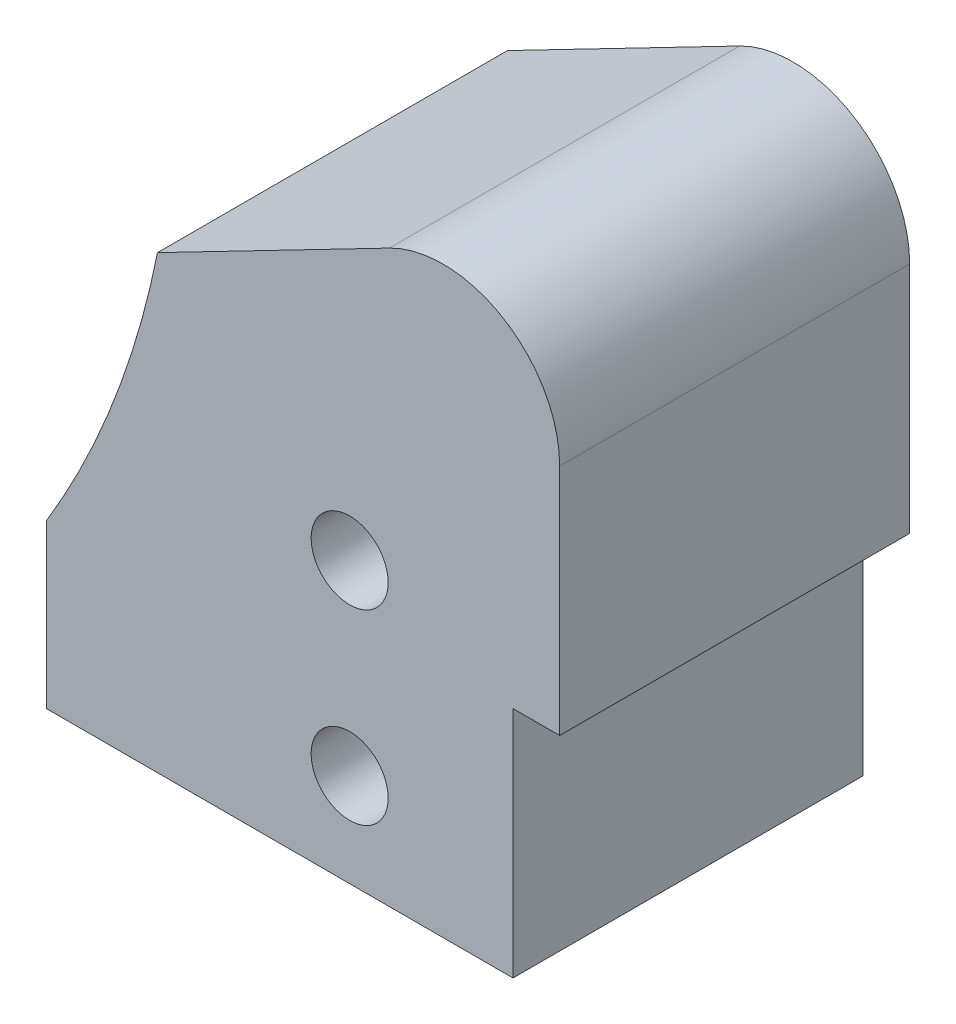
ISO-10303-21;
HEADER;
FILE_DESCRIPTION(('STEP AP214'),'2;1');
FILE_NAME('part.step','',(''),(''),'','','');
FILE_SCHEMA(('AUTOMOTIVE_DESIGN { 1 0 10303 214 1 1 1 1 }'));
ENDSEC;
DATA;
#1=APPLICATION_CONTEXT('core data for automotive mechanical design processes');
#2=APPLICATION_PROTOCOL_DEFINITION('international standard','automotive_design',2000,#1);
#3=PRODUCT_CONTEXT('',#1,'mechanical');
#4=PRODUCT('Part','Part','',(#3));
#5=PRODUCT_RELATED_PRODUCT_CATEGORY('part','',(#4));
#6=PRODUCT_DEFINITION_FORMATION('','',#4);
#7=PRODUCT_DEFINITION_CONTEXT('part definition',#1,'design');
#8=PRODUCT_DEFINITION('design','',#6,#7);
#9=PRODUCT_DEFINITION_SHAPE('','',#8);
#10=(LENGTH_UNIT() NAMED_UNIT(*) SI_UNIT(.MILLI.,.METRE.));
#11=(NAMED_UNIT(*) PLANE_ANGLE_UNIT() SI_UNIT($,.RADIAN.));
#12=(NAMED_UNIT(*) SI_UNIT($,.STERADIAN.) SOLID_ANGLE_UNIT());
#13=UNCERTAINTY_MEASURE_WITH_UNIT(LENGTH_MEASURE(1.E-05),#10,'distance_accuracy_value','');
#14=(GEOMETRIC_REPRESENTATION_CONTEXT(3) GLOBAL_UNCERTAINTY_ASSIGNED_CONTEXT((#13)) GLOBAL_UNIT_ASSIGNED_CONTEXT((#10,
#11,#12)) REPRESENTATION_CONTEXT('',''));
#15=CARTESIAN_POINT('',(0.,0.,0.));
#16=DIRECTION('',(0.,0.,1.));
#17=DIRECTION('',(1.,0.,0.));
#18=AXIS2_PLACEMENT_3D('',#15,#16,#17);
#19=CARTESIAN_POINT('',(0.,0.,8.));
#20=DIRECTION('',(0.,0.,1.));
#21=DIRECTION('',(1.,0.,0.));
#22=AXIS2_PLACEMENT_3D('',#19,#20,#21);
#23=PLANE('',#22);
#24=CARTESIAN_POINT('',(46.,-22.7966896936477,8.));
#25=DIRECTION('',(0.,0.,-1.));
#26=DIRECTION('',(1.,0.,0.));
#27=AXIS2_PLACEMENT_3D('',#24,#25,#26);
#28=CIRCLE('',#27,1.65);
#29=CARTESIAN_POINT('',(47.65,-22.7966896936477,8.));
#30=VERTEX_POINT('',#29);
#31=EDGE_CURVE('E131',#30,#30,#28,.T.);
#32=ORIENTED_EDGE('',*,*,#31,.F.);
#33=EDGE_LOOP('',(#32));
#34=FACE_BOUND('',#33,.T.);
#35=CARTESIAN_POINT('',(46.,-14.7966896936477,8.));
#36=DIRECTION('',(0.,0.,-1.));
#37=DIRECTION('',(1.,0.,0.));
#38=AXIS2_PLACEMENT_3D('',#35,#36,#37);
#39=CIRCLE('',#38,1.65);
#40=CARTESIAN_POINT('',(47.65,-14.7966896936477,8.));
#41=VERTEX_POINT('',#40);
#42=EDGE_CURVE('E225',#41,#41,#39,.T.);
#43=ORIENTED_EDGE('',*,*,#42,.F.);
#44=EDGE_LOOP('',(#43));
#45=FACE_BOUND('',#44,.T.);
#46=CARTESIAN_POINT('',(50.,-6.79668969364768,8.));
#47=DIRECTION('',(0.,0.,-1.));
#48=DIRECTION('',(1.,0.,0.));
#49=AXIS2_PLACEMENT_3D('',#46,#47,#48);
#50=CIRCLE('',#49,5.);
#51=CARTESIAN_POINT('',(47.7037551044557,-2.3551517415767,8.));
#52=VERTEX_POINT('',#51);
#53=CARTESIAN_POINT('',(55.,-6.79668969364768,8.));
#54=VERTEX_POINT('',#53);
#55=EDGE_CURVE('E105',#52,#54,#50,.T.);
#56=ORIENTED_EDGE('',*,*,#55,.T.);
#57=DIRECTION('',(0.,1.,0.));
#58=VECTOR('',#57,1.);
#59=CARTESIAN_POINT('',(55.,-68.,8.));
#60=LINE('',#59,#58);
#61=CARTESIAN_POINT('',(55.,-16.7966896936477,8.));
#62=VERTEX_POINT('',#61);
#63=EDGE_CURVE('E156',#62,#54,#60,.T.);
#64=ORIENTED_EDGE('',*,*,#63,.F.);
#65=DIRECTION('',(1.,0.,0.));
#66=VECTOR('',#65,1.);
#67=CARTESIAN_POINT('',(0.,-16.7966896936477,8.));
#68=LINE('',#67,#66);
#69=CARTESIAN_POINT('',(53.,-16.7966896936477,8.));
#70=VERTEX_POINT('',#69);
#71=EDGE_CURVE('E26',#70,#62,#68,.T.);
#72=ORIENTED_EDGE('',*,*,#71,.F.);
#73=DIRECTION('',(0.,1.,0.));
#74=VECTOR('',#73,1.);
#75=CARTESIAN_POINT('',(53.,0.,8.));
#76=LINE('',#75,#74);
#77=CARTESIAN_POINT('',(53.,-26.7966896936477,8.));
#78=VERTEX_POINT('',#77);
#79=EDGE_CURVE('E186',#78,#70,#76,.T.);
#80=ORIENTED_EDGE('',*,*,#79,.F.);
#81=DIRECTION('',(1.,0.,0.));
#82=VECTOR('',#81,1.);
#83=CARTESIAN_POINT('',(0.,-26.7966896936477,8.));
#84=LINE('',#83,#82);
#85=CARTESIAN_POINT('',(33.,-26.7966896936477,8.));
#86=VERTEX_POINT('',#85);
#87=EDGE_CURVE('E177',#86,#78,#84,.T.);
#88=ORIENTED_EDGE('',*,*,#87,.F.);
#89=DIRECTION('',(0.,-1.,0.));
#90=VECTOR('',#89,1.);
#91=CARTESIAN_POINT('',(33.,0.,8.));
#92=LINE('',#91,#90);
#93=CARTESIAN_POINT('',(33.,-19.8305320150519,8.));
#94=VERTEX_POINT('',#93);
#95=EDGE_CURVE('E165',#94,#86,#92,.T.);
#96=ORIENTED_EDGE('',*,*,#95,.F.);
#97=CARTESIAN_POINT('',(0.,0.,8.));
#98=DIRECTION('',(0.,0.,1.));
#99=DIRECTION('',(1.,0.,0.));
#100=AXIS2_PLACEMENT_3D('',#97,#98,#99);
#101=CIRCLE('',#100,38.5);
#102=CARTESIAN_POINT('',(37.7635751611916,-7.49415712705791,8.));
#103=VERTEX_POINT('',#102);
#104=EDGE_CURVE('E127',#94,#103,#101,.T.);
#105=ORIENTED_EDGE('',*,*,#104,.T.);
#106=DIRECTION('',(-0.888307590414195,-0.459248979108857,0.));
#107=VECTOR('',#106,1.);
#108=CARTESIAN_POINT('',(55.,1.41695721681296,8.));
#109=LINE('',#108,#107);
#110=EDGE_CURVE('E121',#52,#103,#109,.T.);
#111=ORIENTED_EDGE('',*,*,#110,.F.);
#112=EDGE_LOOP('',(#56,#64,#72,#80,#88,#96,#105,#111));
#113=FACE_BOUND('',#112,.T.);
#114=ADVANCED_FACE('F17',(#34,#45,#113),#23,.F.);
#115=CARTESIAN_POINT('',(0.,0.,23.));
#116=DIRECTION('',(0.,0.,1.));
#117=DIRECTION('',(1.,0.,0.));
#118=AXIS2_PLACEMENT_3D('',#115,#116,#117);
#119=PLANE('',#118);
#120=CARTESIAN_POINT('',(46.,-14.7966896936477,23.));
#121=DIRECTION('',(0.,0.,-1.));
#122=DIRECTION('',(1.,0.,0.));
#123=AXIS2_PLACEMENT_3D('',#120,#121,#122);
#124=CIRCLE('',#123,1.65);
#125=CARTESIAN_POINT('',(47.65,-14.7966896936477,23.));
#126=VERTEX_POINT('',#125);
#127=EDGE_CURVE('E228',#126,#126,#124,.T.);
#128=ORIENTED_EDGE('',*,*,#127,.T.);
#129=EDGE_LOOP('',(#128));
#130=FACE_BOUND('',#129,.T.);
#131=CARTESIAN_POINT('',(46.,-22.7966896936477,23.));
#132=DIRECTION('',(0.,0.,-1.));
#133=DIRECTION('',(1.,0.,0.));
#134=AXIS2_PLACEMENT_3D('',#131,#132,#133);
#135=CIRCLE('',#134,1.65);
#136=CARTESIAN_POINT('',(47.65,-22.7966896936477,23.));
#137=VERTEX_POINT('',#136);
#138=EDGE_CURVE('E141',#137,#137,#135,.T.);
#139=ORIENTED_EDGE('',*,*,#138,.T.);
#140=EDGE_LOOP('',(#139));
#141=FACE_BOUND('',#140,.T.);
#142=CARTESIAN_POINT('',(0.,0.,23.));
#143=DIRECTION('',(0.,0.,1.));
#144=DIRECTION('',(1.,0.,0.));
#145=AXIS2_PLACEMENT_3D('',#142,#143,#144);
#146=CIRCLE('',#145,38.5);
#147=CARTESIAN_POINT('',(33.,-19.8305320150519,23.));
#148=VERTEX_POINT('',#147);
#149=CARTESIAN_POINT('',(37.7635751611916,-7.49415712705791,23.));
#150=VERTEX_POINT('',#149);
#151=EDGE_CURVE('E164',#148,#150,#146,.T.);
#152=ORIENTED_EDGE('',*,*,#151,.F.);
#153=DIRECTION('',(0.,-1.,0.));
#154=VECTOR('',#153,1.);
#155=CARTESIAN_POINT('',(33.,0.,23.));
#156=LINE('',#155,#154);
#157=CARTESIAN_POINT('',(33.,-26.7966896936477,23.));
#158=VERTEX_POINT('',#157);
#159=EDGE_CURVE('E173',#148,#158,#156,.T.);
#160=ORIENTED_EDGE('',*,*,#159,.T.);
#161=DIRECTION('',(1.,0.,0.));
#162=VECTOR('',#161,1.);
#163=CARTESIAN_POINT('',(0.,-26.7966896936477,23.));
#164=LINE('',#163,#162);
#165=CARTESIAN_POINT('',(53.,-26.7966896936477,23.));
#166=VERTEX_POINT('',#165);
#167=EDGE_CURVE('E182',#158,#166,#164,.T.);
#168=ORIENTED_EDGE('',*,*,#167,.T.);
#169=DIRECTION('',(0.,1.,0.));
#170=VECTOR('',#169,1.);
#171=CARTESIAN_POINT('',(53.,0.,23.));
#172=LINE('',#171,#170);
#173=CARTESIAN_POINT('',(53.,-16.7966896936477,23.));
#174=VERTEX_POINT('',#173);
#175=EDGE_CURVE('E193',#166,#174,#172,.T.);
#176=ORIENTED_EDGE('',*,*,#175,.T.);
#177=DIRECTION('',(1.,0.,0.));
#178=VECTOR('',#177,1.);
#179=CARTESIAN_POINT('',(0.,-16.7966896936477,23.));
#180=LINE('',#179,#178);
#181=CARTESIAN_POINT('',(55.,-16.7966896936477,23.));
#182=VERTEX_POINT('',#181);
#183=EDGE_CURVE('E11',#174,#182,#180,.T.);
#184=ORIENTED_EDGE('',*,*,#183,.T.);
#185=DIRECTION('',(0.,1.,0.));
#186=VECTOR('',#185,1.);
#187=CARTESIAN_POINT('',(55.,0.,23.));
#188=LINE('',#187,#186);
#189=CARTESIAN_POINT('',(55.,-6.79668969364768,23.));
#190=VERTEX_POINT('',#189);
#191=EDGE_CURVE('E151',#182,#190,#188,.T.);
#192=ORIENTED_EDGE('',*,*,#191,.T.);
#193=CARTESIAN_POINT('',(50.,-6.79668969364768,23.));
#194=DIRECTION('',(0.,0.,1.));
#195=DIRECTION('',(1.,0.,0.));
#196=AXIS2_PLACEMENT_3D('',#193,#194,#195);
#197=CIRCLE('',#196,5.);
#198=CARTESIAN_POINT('',(47.7037551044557,-2.3551517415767,23.));
#199=VERTEX_POINT('',#198);
#200=EDGE_CURVE('E115',#190,#199,#197,.T.);
#201=ORIENTED_EDGE('',*,*,#200,.T.);
#202=DIRECTION('',(-0.888307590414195,-0.459248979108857,0.));
#203=VECTOR('',#202,1.);
#204=CARTESIAN_POINT('',(11.0219754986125,-21.3193821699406,23.));
#205=LINE('',#204,#203);
#206=EDGE_CURVE('E123',#199,#150,#205,.T.);
#207=ORIENTED_EDGE('',*,*,#206,.T.);
#208=EDGE_LOOP('',(#152,#160,#168,#176,#184,#192,#201,#207));
#209=FACE_BOUND('',#208,.T.);
#210=ADVANCED_FACE('F19',(#130,#141,#209),#119,.T.);
#211=CARTESIAN_POINT('',(0.,-16.7966896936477,23.));
#212=DIRECTION('',(0.,1.,0.));
#213=DIRECTION('',(1.,0.,0.));
#214=AXIS2_PLACEMENT_3D('',#211,#212,#213);
#215=PLANE('',#214);
#216=ORIENTED_EDGE('',*,*,#71,.T.);
#217=DIRECTION('',(0.,0.,-1.));
#218=VECTOR('',#217,1.);
#219=CARTESIAN_POINT('',(55.,-16.7966896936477,23.));
#220=LINE('',#219,#218);
#221=EDGE_CURVE('E152',#182,#62,#220,.T.);
#222=ORIENTED_EDGE('',*,*,#221,.F.);
#223=ORIENTED_EDGE('',*,*,#183,.F.);
#224=DIRECTION('',(0.,0.,-1.));
#225=VECTOR('',#224,1.);
#226=CARTESIAN_POINT('',(53.,-16.7966896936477,23.));
#227=LINE('',#226,#225);
#228=EDGE_CURVE('E190',#174,#70,#227,.T.);
#229=ORIENTED_EDGE('',*,*,#228,.T.);
#230=EDGE_LOOP('',(#216,#222,#223,#229));
#231=FACE_BOUND('',#230,.T.);
#232=ADVANCED_FACE('F198',(#231),#215,.F.);
#233=CARTESIAN_POINT('',(53.,0.,23.));
#234=DIRECTION('',(-1.,0.,0.));
#235=DIRECTION('',(0.,0.,1.));
#236=AXIS2_PLACEMENT_3D('',#233,#234,#235);
#237=PLANE('',#236);
#238=ORIENTED_EDGE('',*,*,#79,.T.);
#239=ORIENTED_EDGE('',*,*,#228,.F.);
#240=ORIENTED_EDGE('',*,*,#175,.F.);
#241=DIRECTION('',(0.,0.,-1.));
#242=VECTOR('',#241,1.);
#243=CARTESIAN_POINT('',(53.,-26.7966896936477,23.));
#244=LINE('',#243,#242);
#245=EDGE_CURVE('E178',#166,#78,#244,.T.);
#246=ORIENTED_EDGE('',*,*,#245,.T.);
#247=EDGE_LOOP('',(#238,#239,#240,#246));
#248=FACE_BOUND('',#247,.T.);
#249=ADVANCED_FACE('F207',(#248),#237,.F.);
#250=CARTESIAN_POINT('',(0.,-26.7966896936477,23.));
#251=DIRECTION('',(0.,1.,0.));
#252=DIRECTION('',(1.,0.,0.));
#253=AXIS2_PLACEMENT_3D('',#250,#251,#252);
#254=PLANE('',#253);
#255=ORIENTED_EDGE('',*,*,#87,.T.);
#256=ORIENTED_EDGE('',*,*,#245,.F.);
#257=ORIENTED_EDGE('',*,*,#167,.F.);
#258=DIRECTION('',(0.,0.,-1.));
#259=VECTOR('',#258,1.);
#260=CARTESIAN_POINT('',(33.,-26.7966896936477,23.));
#261=LINE('',#260,#259);
#262=EDGE_CURVE('E169',#158,#86,#261,.T.);
#263=ORIENTED_EDGE('',*,*,#262,.T.);
#264=EDGE_LOOP('',(#255,#256,#257,#263));
#265=FACE_BOUND('',#264,.T.);
#266=ADVANCED_FACE('F213',(#265),#254,.F.);
#267=CARTESIAN_POINT('',(33.,0.,23.));
#268=DIRECTION('',(1.,0.,0.));
#269=DIRECTION('',(0.,1.,0.));
#270=AXIS2_PLACEMENT_3D('',#267,#268,#269);
#271=PLANE('',#270);
#272=ORIENTED_EDGE('',*,*,#95,.T.);
#273=ORIENTED_EDGE('',*,*,#262,.F.);
#274=ORIENTED_EDGE('',*,*,#159,.F.);
#275=DIRECTION('',(0.,0.,-1.));
#276=VECTOR('',#275,1.);
#277=CARTESIAN_POINT('',(33.,-19.8305320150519,23.));
#278=LINE('',#277,#276);
#279=EDGE_CURVE('E150',#148,#94,#278,.T.);
#280=ORIENTED_EDGE('',*,*,#279,.T.);
#281=EDGE_LOOP('',(#272,#273,#274,#280));
#282=FACE_BOUND('',#281,.T.);
#283=ADVANCED_FACE('F215',(#282),#271,.F.);
#284=CARTESIAN_POINT('',(0.,0.,23.));
#285=DIRECTION('',(0.,0.,-1.));
#286=DIRECTION('',(-1.,0.,0.));
#287=AXIS2_PLACEMENT_3D('',#284,#285,#286);
#288=CYLINDRICAL_SURFACE('',#287,38.5);
#289=ORIENTED_EDGE('',*,*,#104,.F.);
#290=ORIENTED_EDGE('',*,*,#279,.F.);
#291=ORIENTED_EDGE('',*,*,#151,.T.);
#292=DIRECTION('',(0.,0.,-1.));
#293=VECTOR('',#292,1.);
#294=CARTESIAN_POINT('',(37.7635751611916,-7.49415712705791,23.));
#295=LINE('',#294,#293);
#296=EDGE_CURVE('E130',#150,#103,#295,.T.);
#297=ORIENTED_EDGE('',*,*,#296,.T.);
#298=EDGE_LOOP('',(#289,#290,#291,#297));
#299=FACE_BOUND('',#298,.T.);
#300=ADVANCED_FACE('F218',(#299),#288,.F.);
#301=CARTESIAN_POINT('',(55.,-68.,8.));
#302=DIRECTION('',(-1.,0.,0.));
#303=DIRECTION('',(0.,0.,1.));
#304=AXIS2_PLACEMENT_3D('',#301,#302,#303);
#305=PLANE('',#304);
#306=ORIENTED_EDGE('',*,*,#221,.T.);
#307=ORIENTED_EDGE('',*,*,#63,.T.);
#308=DIRECTION('',(0.,0.,1.));
#309=VECTOR('',#308,1.);
#310=CARTESIAN_POINT('',(55.,-6.79668969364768,8.));
#311=LINE('',#310,#309);
#312=EDGE_CURVE('E112',#54,#190,#311,.T.);
#313=ORIENTED_EDGE('',*,*,#312,.T.);
#314=ORIENTED_EDGE('',*,*,#191,.F.);
#315=EDGE_LOOP('',(#306,#307,#313,#314));
#316=FACE_BOUND('',#315,.T.);
#317=ADVANCED_FACE('F202',(#316),#305,.F.);
#318=CARTESIAN_POINT('',(50.,-6.79668969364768,2.));
#319=DIRECTION('',(0.,0.,1.));
#320=DIRECTION('',(1.,0.,0.));
#321=AXIS2_PLACEMENT_3D('',#318,#319,#320);
#322=CYLINDRICAL_SURFACE('',#321,5.);
#323=ORIENTED_EDGE('',*,*,#55,.F.);
#324=DIRECTION('',(0.,0.,-1.));
#325=VECTOR('',#324,1.);
#326=CARTESIAN_POINT('',(47.7037551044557,-2.35515174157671,-108.));
#327=LINE('',#326,#325);
#328=EDGE_CURVE('E109',#199,#52,#327,.T.);
#329=ORIENTED_EDGE('',*,*,#328,.F.);
#330=ORIENTED_EDGE('',*,*,#200,.F.);
#331=ORIENTED_EDGE('',*,*,#312,.F.);
#332=EDGE_LOOP('',(#323,#329,#330,#331));
#333=FACE_BOUND('',#332,.T.);
#334=ADVANCED_FACE('F107',(#333),#322,.T.);
#335=CARTESIAN_POINT('',(11.0219754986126,-21.3193821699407,2.));
#336=DIRECTION('',(-0.459248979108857,0.888307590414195,0.));
#337=DIRECTION('',(0.,0.,1.));
#338=AXIS2_PLACEMENT_3D('',#335,#336,#337);
#339=PLANE('',#338);
#340=ORIENTED_EDGE('',*,*,#110,.T.);
#341=ORIENTED_EDGE('',*,*,#296,.F.);
#342=ORIENTED_EDGE('',*,*,#206,.F.);
#343=ORIENTED_EDGE('',*,*,#328,.T.);
#344=EDGE_LOOP('',(#340,#341,#342,#343));
#345=FACE_BOUND('',#344,.T.);
#346=ADVANCED_FACE('F119',(#345),#339,.T.);
#347=CARTESIAN_POINT('',(46.,-22.7966896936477,27.));
#348=DIRECTION('',(0.,0.,-1.));
#349=DIRECTION('',(-1.,0.,0.));
#350=AXIS2_PLACEMENT_3D('',#347,#348,#349);
#351=CYLINDRICAL_SURFACE('',#350,1.65);
#352=ORIENTED_EDGE('',*,*,#31,.T.);
#353=EDGE_LOOP('',(#352));
#354=FACE_BOUND('',#353,.T.);
#355=ORIENTED_EDGE('',*,*,#138,.F.);
#356=EDGE_LOOP('',(#355));
#357=FACE_BOUND('',#356,.T.);
#358=ADVANCED_FACE('F236',(#354,#357),#351,.F.);
#359=CARTESIAN_POINT('',(46.,-14.7966896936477,27.));
#360=DIRECTION('',(0.,0.,-1.));
#361=DIRECTION('',(-1.,0.,0.));
#362=AXIS2_PLACEMENT_3D('',#359,#360,#361);
#363=CYLINDRICAL_SURFACE('',#362,1.65);
#364=ORIENTED_EDGE('',*,*,#42,.T.);
#365=EDGE_LOOP('',(#364));
#366=FACE_BOUND('',#365,.T.);
#367=ORIENTED_EDGE('',*,*,#127,.F.);
#368=EDGE_LOOP('',(#367));
#369=FACE_BOUND('',#368,.T.);
#370=ADVANCED_FACE('F238',(#366,#369),#363,.F.);
#371=CLOSED_SHELL('',(#114,#210,#232,#249,#266,#283,#300,#317,#334,#346,#358,#370));
#372=MANIFOLD_SOLID_BREP('B1',#371);
#373=ADVANCED_BREP_SHAPE_REPRESENTATION('',(#18,#372),#14);
#374=SHAPE_DEFINITION_REPRESENTATION(#9,#373);
ENDSEC;
END-ISO-10303-21;
